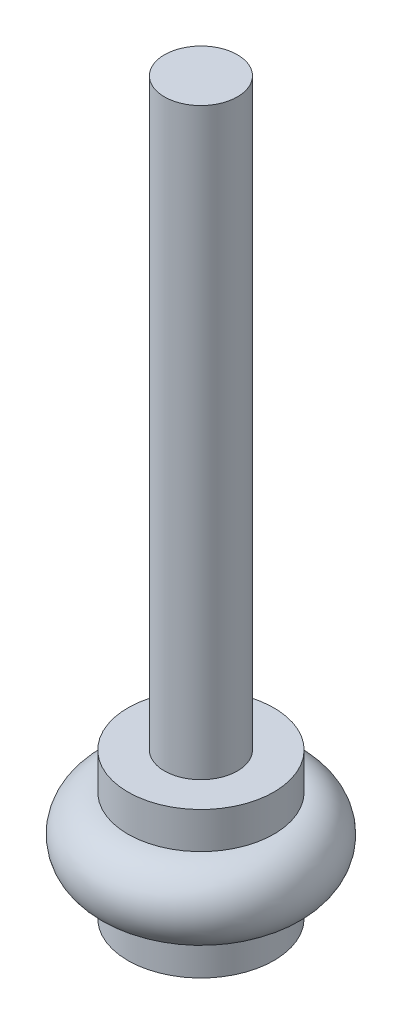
from build123d import *


with BuildPart() as part:
    # Sketch1 → Revolve1 (revolve)
    with BuildSketch(Plane.XY, mode=Mode.PRIVATE) as revolve1_sk:
        with BuildLine():
            Line((0, 0), (0, 63.5))
            Line((0, 63.5), (3.175, 63.5))
            Line((3.175, 63.5), (3.175, 12.7))
            Line((3.175, 12.7), (6.35, 12.7))
            Line((6.35, 12.7), (6.35, 9.525))
            ThreePointArc((6.35, 9.525), (9.525, 6.35), (6.35, 3.175))
            Line((6.35, 3.175), (6.35, 0))
            Line((6.35, 0), (0, 0))
        make_face()
    revolve(revolve1_sk.sketch.rotate(Axis((0, 0, 0), (0, -1, 0)), 90), axis=Axis((0, 0, 0), (0, -1, 0)))


solid = part.part
